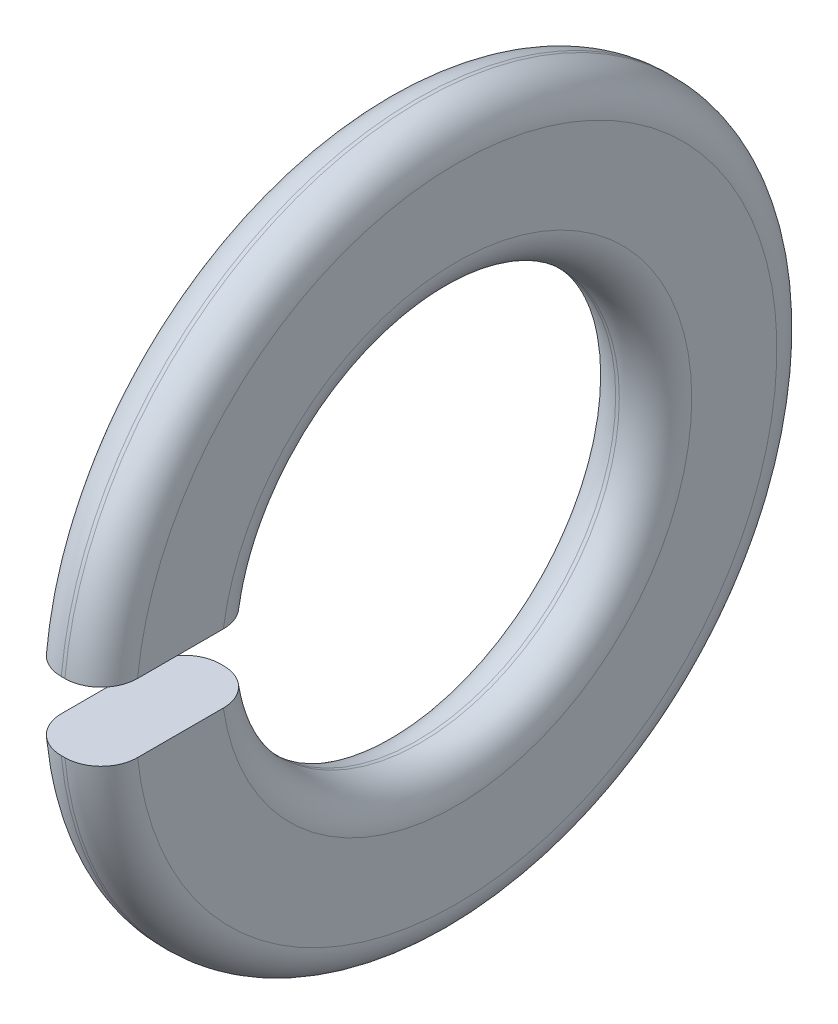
from build123d import *

# Parameters (mm, degrees)
SKETCH2_W = 1.89
SKETCH2_H = 10.047
GAP_DEPTH = 15.087405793


with BuildPart() as part:
    # Sketch1 → Base-Revolve (revolve)
    with BuildSketch(Plane.XY, mode=Mode.PRIVATE) as base_revolve_sk:
        with BuildLine():
            Line((0, 6.5), (0, 8.85))
            ThreePointArc((0, 8.85), (-0.292893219, 9.557106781), (-1, 9.85))
            Line((-1, 9.85), (-1.1, 9.85))
            ThreePointArc((-1.1, 9.85), (-1.807106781, 9.557106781), (-2.1, 8.85))
            Line((-2.1, 8.85), (-2.1, 6.5))
            ThreePointArc((-2.1, 6.5), (-1.807106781, 5.792893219), (-1.1, 5.5))
            Line((-1.1, 5.5), (-1, 5.5))
            ThreePointArc((-1, 5.5), (-0.292893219, 5.792893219), (0, 6.5))
        make_face()
    revolve(base_revolve_sk.sketch.rotate(Axis((-34.925, 0, 0), (1, 0, 0)), 90), axis=Axis((-34.925, 0, 0), (1, 0, 0)))

    # Sketch2 → Gap (cut, through all)
    with BuildSketch(Plane(origin=(0, 0, 0), x_dir=(0, -1, 0), z_dir=(-1, 0, 0))):
        with Locations((0, 5.0235)):
            Rectangle(SKETCH2_W, SKETCH2_H)
    extrude(amount=GAP_DEPTH, mode=Mode.SUBTRACT)


solid = part.part
